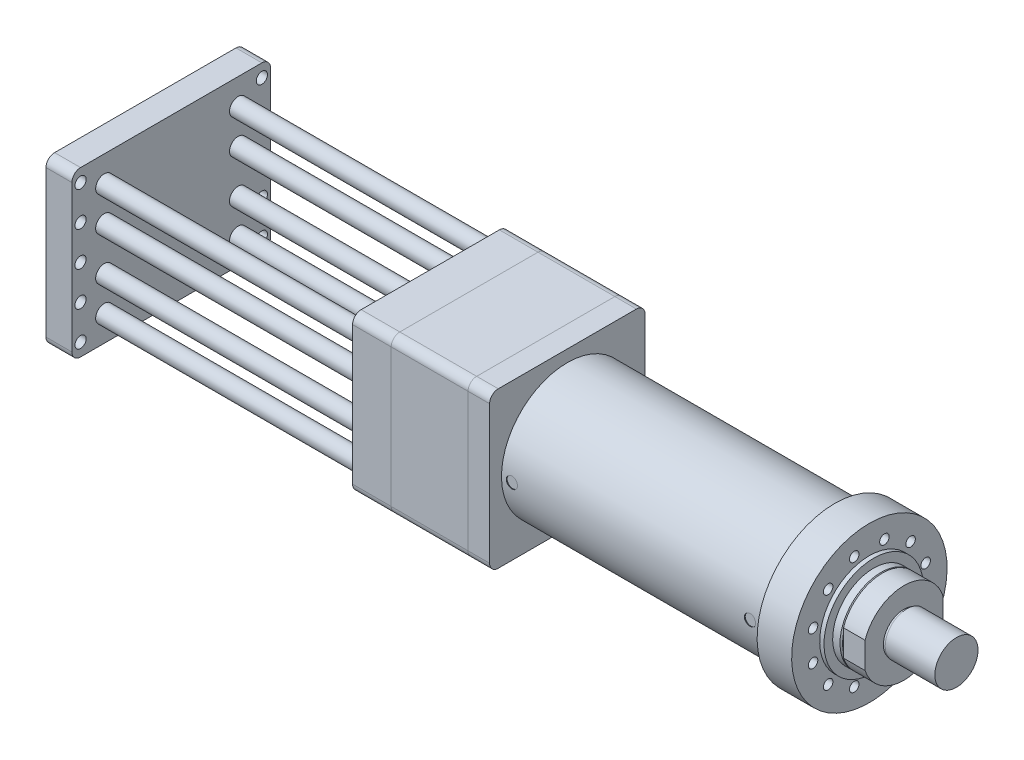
from build123d import *

# Parameters (mm, degrees)
SKETCH_2_W          = 619.5
SKETCH_2_H          = 152.5
SKETCH_3_R          = 180
SKETCH_3_R_2        = 11
EXTRUDE_1_DEPTH     = 80
SKETCH_4_R          = 115
EXTRUDE_2_DEPTH     = 10
SKETCH_5_R          = 95
EXTRUDE_3_DEPTH     = 20
CHAMFER_1_SIZE      = 3
SKETCH_17_R         = 13
CUT_EXTRUDE_6_DEPTH = 2
SKETCH_19_R         = 13
CUT_EXTRUDE_7_DEPTH = 2
SKETCH_23_W         = 360
SKETCH_23_H         = 360
EXTRUDE_8_DEPTH     = 50
EXTRUDE_9_DEPTH     = 50
SKETCH_25_R         = 47.5
EXTRUDE_10_DEPTH    = 5
SKETCH_26_R         = 50
EXTRUDE_11_DEPTH    = 115
SKETCH_28_W         = 360
SKETCH_28_H         = 360
EXTRUDE_12_DEPTH    = 178
SKETCH_29_W         = 360
SKETCH_29_H         = 360
EXTRUDE_13_DEPTH    = 89.5
FILLET_1_R          = 20
FILLET_2_R          = 20
FILLET_3_R          = 20
SKETCH_30_R         = 20
EXTRUDE_14_DEPTH    = 600
SKETCH_31_W         = 460
SKETCH_31_H         = 380
SKETCH_31_R         = 13
EXTRUDE_15_DEPTH    = 60
FILLET_4_R          = 20


with BuildPart() as part:
    # Sketch 2 → Revolve 1 (revolve)
    with BuildSketch(Plane.XY):
        with Locations((309.75, 76.25)):
            Rectangle(SKETCH_2_W, SKETCH_2_H)
    revolve(axis=Axis((619.5, 0, 0), (-1, 0, 0)))

    # Sketch 3 → Extrude 1 (add)
    with BuildSketch(Plane(origin=(619.5, 0, 0), x_dir=(0, 0, -1), z_dir=(1, 0, 0))):
        with Locations(Location((0, 0, 0), (0, 0, 90))):
            Circle(SKETCH_3_R)
        with Locations(Location((130.399986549, 34.940571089, 0), (0, 0, 90))):
            Circle(SKETCH_3_R_2, mode=Mode.SUBTRACT)
        with Locations(Location((130.399986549, -34.940571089, 0), (0, 0, 90))):
            Circle(SKETCH_3_R_2, mode=Mode.SUBTRACT)
        with Locations(Location((95.45941546, -95.45941546, 0), (0, 0, 90))):
            Circle(SKETCH_3_R_2, mode=Mode.SUBTRACT)
        with Locations(Location((34.940571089, -130.399986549, 0), (0, 0, 90))):
            Circle(SKETCH_3_R_2, mode=Mode.SUBTRACT)
        with Locations(Location((-34.940571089, -130.399986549, 0), (0, 0, 90))):
            Circle(SKETCH_3_R_2, mode=Mode.SUBTRACT)
        with Locations(Location((-95.45941546, -95.45941546, 0), (0, 0, 90))):
            Circle(SKETCH_3_R_2, mode=Mode.SUBTRACT)
        with Locations(Location((-130.399986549, -34.940571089, 0), (0, 0, 90))):
            Circle(SKETCH_3_R_2, mode=Mode.SUBTRACT)
        with Locations(Location((-130.399986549, 34.940571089, 0), (0, 0, 90))):
            Circle(SKETCH_3_R_2, mode=Mode.SUBTRACT)
        with Locations(Location((-95.45941546, 95.45941546, 0), (0, 0, 90))):
            Circle(SKETCH_3_R_2, mode=Mode.SUBTRACT)
        with Locations(Location((-34.940571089, 130.399986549, 0), (0, 0, 90))):
            Circle(SKETCH_3_R_2, mode=Mode.SUBTRACT)
        with Locations(Location((34.940571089, 130.399986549, 0), (0, 0, 90))):
            Circle(SKETCH_3_R_2, mode=Mode.SUBTRACT)
        with Locations(Location((95.45941546, 95.45941546, 0), (0, 0, 90))):
            Circle(SKETCH_3_R_2, mode=Mode.SUBTRACT)
    extrude(amount=EXTRUDE_1_DEPTH)

    # Sketch 4 → Extrude 2 (add)
    with BuildSketch(Plane(origin=(699.5, 0, 0), x_dir=(0, 0, -1), z_dir=(1, 0, 0))):
        with Locations(Location((0, 0, 0), (0, 0, 90))):
            Circle(SKETCH_4_R)
    extrude(amount=EXTRUDE_2_DEPTH)

    # Sketch 5 → Extrude 3 (add)
    with BuildSketch(Plane(origin=(709.5, 0, 0), x_dir=(0, 0, -1), z_dir=(1, 0, 0))):
        with Locations(Location((0, 0, 0), (0, 0, 90))):
            Circle(SKETCH_5_R)
    extrude(amount=EXTRUDE_3_DEPTH)

    # Chamfer 1
    chamfer_1_edges = [part.edges().sort_by_distance(p)[0] for p in [
        (729.5, -95, 0),
    ]]
    chamfer(chamfer_1_edges, length=CHAMFER_1_SIZE)

    # Sketch 17 → Cut-Extrude 6 (cut)
    with BuildSketch(Plane.XY.offset(-152.5)):
        with Locations(Location((44, 0, 0), (0, 0, 180))):
            Circle(SKETCH_17_R)
    extrude(amount=CUT_EXTRUDE_6_DEPTH, mode=Mode.SUBTRACT)

    # Sketch 19 → Cut-Extrude 7 (cut)
    with BuildSketch(Plane.XY.offset(152.5)):
        with Locations((24, 0)):
            Circle(SKETCH_19_R)
        with Locations((575.5, 0)):
            Circle(SKETCH_19_R)
    extrude(amount=-CUT_EXTRUDE_7_DEPTH, mode=Mode.SUBTRACT)

    # Sketch 23 → Extrude 8 (add)
    with BuildSketch(Plane.ZY):
        Rectangle(SKETCH_23_W, SKETCH_23_H)
    extrude(amount=EXTRUDE_8_DEPTH)

    # Sketch 24 → Extrude 9 (add)
    with BuildSketch(Plane(origin=(729.5, 0, 0), x_dir=(0, 0, -1), z_dir=(1, 0, 0))):
        with BuildLine():
            Line((-90, 30.413812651), (-90, -30.413812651))
            ThreePointArc((-90, -30.413812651), (0, -95), (90, -30.413812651))
            Line((90, -30.413812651), (90, 30.413812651))
            ThreePointArc((90, 30.413812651), (0, 95), (-90, 30.413812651))
        make_face()
    extrude(amount=EXTRUDE_9_DEPTH)

    # Sketch 25 → Extrude 10 (add)
    with BuildSketch(Plane(origin=(779.5, 0, 0), x_dir=(0, 0, -1), z_dir=(1, 0, 0))):
        with Locations(Location((0, 0, 0), (0, 0, 90))):
            Circle(SKETCH_25_R)
    extrude(amount=EXTRUDE_10_DEPTH)

    # Sketch 26 → Extrude 11 (add)
    with BuildSketch(Plane(origin=(784.5, 0, 0), x_dir=(0, 0, -1), z_dir=(1, 0, 0))):
        with Locations(Location((1.643994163, 0, 0), (0, 0, 90))):
            Circle(SKETCH_26_R)
    extrude(amount=EXTRUDE_11_DEPTH)

    # Fillet 1
    fillet_1_edges = [part.edges().sort_by_distance(p)[0] for p in [
        (-25, -180, 180),
        (-25, 180, 180),
        (-25, 180, -180),
        (-25, -180, -180),
    ]]
    fillet(fillet_1_edges, radius=FILLET_1_R)


with BuildPart() as body_2:
    # Sketch 28 → Extrude 12 (new body)
    with BuildSketch(Plane.ZY.offset(50)):
        Rectangle(SKETCH_28_W, SKETCH_28_H)
    extrude(amount=EXTRUDE_12_DEPTH)

    # Fillet 2
    fillet_2_edges = [body_2.edges().sort_by_distance(p)[0] for p in [
        (-139, -180, 180),
        (-139, -180, -180),
        (-139, 180, -180),
        (-139, 180, 180),
    ]]
    fillet(fillet_2_edges, radius=FILLET_2_R)


with BuildPart() as body_3:
    # Sketch 29 → Extrude 13 (new body)
    with BuildSketch(Plane.ZY.offset(228)):
        Rectangle(SKETCH_29_W, SKETCH_29_H)
    extrude(amount=EXTRUDE_13_DEPTH)

    # Fillet 3
    fillet_3_edges = [body_3.edges().sort_by_distance(p)[0] for p in [
        (-272.75, -180, 180),
        (-272.75, -180, -180),
        (-272.75, 180, -180),
        (-272.75, 180, 180),
    ]]
    fillet(fillet_3_edges, radius=FILLET_3_R)

    # Sketch 30 → Extrude 14 (add)
    with BuildSketch(Plane.ZY.offset(317.5)):
        with Locations(Location((-155, 130, 0), (0, 0, 270))):
            Circle(SKETCH_30_R)
        with Locations(Location((-155, 50, 0), (0, 0, 270))):
            Circle(SKETCH_30_R)
        with Locations(Location((-155, -50, 0), (0, 0, 270))):
            Circle(SKETCH_30_R)
        with Locations(Location((-155, -130, 0), (0, 0, 270))):
            Circle(SKETCH_30_R)
        with Locations(Location((155, -130, 0), (0, 0, 90))):
            Circle(SKETCH_30_R)
        with Locations(Location((155, -50, 0), (0, 0, 90))):
            Circle(SKETCH_30_R)
        with Locations(Location((155, 50, 0), (0, 0, 90))):
            Circle(SKETCH_30_R)
        with Locations(Location((155, 130, 0), (0, 0, 90))):
            Circle(SKETCH_30_R)
    extrude(amount=EXTRUDE_14_DEPTH)

    # Sketch 31 → Extrude 15 (add)
    with BuildSketch(Plane.ZY.offset(917.5)):
        Rectangle(SKETCH_31_W, SKETCH_31_H)
        with Locations(Location((-210, 160, 0), (0, 0, 270))):
            Circle(SKETCH_31_R, mode=Mode.SUBTRACT)
        with Locations(Location((-210, 0, 0), (0, 0, 270))):
            Circle(SKETCH_31_R, mode=Mode.SUBTRACT)
        with Locations(Location((-210, -80, 0), (0, 0, 270))):
            Circle(SKETCH_31_R, mode=Mode.SUBTRACT)
        with Locations(Location((-210, -160, 0), (0, 0, 270))):
            Circle(SKETCH_31_R, mode=Mode.SUBTRACT)
        with Locations(Location((-210, 80, 0), (0, 0, 270))):
            Circle(SKETCH_31_R, mode=Mode.SUBTRACT)
        with Locations(Location((210, -160, 0), (0, 0, 90))):
            Circle(SKETCH_31_R, mode=Mode.SUBTRACT)
        with Locations(Location((210, -80, 0), (0, 0, 90))):
            Circle(SKETCH_31_R, mode=Mode.SUBTRACT)
        with Locations(Location((210, 0, 0), (0, 0, 90))):
            Circle(SKETCH_31_R, mode=Mode.SUBTRACT)
        with Locations(Location((210, 80, 0), (0, 0, 90))):
            Circle(SKETCH_31_R, mode=Mode.SUBTRACT)
        with Locations(Location((210, 160, 0), (0, 0, 90))):
            Circle(SKETCH_31_R, mode=Mode.SUBTRACT)
    extrude(amount=EXTRUDE_15_DEPTH)

    # Fillet 4
    fillet_4_edges = [body_3.edges().sort_by_distance(p)[0] for p in [
        (-947.5, -190, 230),
        (-947.5, 190, 230),
        (-947.5, 190, -230),
        (-947.5, -190, -230),
    ]]
    fillet(fillet_4_edges, radius=FILLET_4_R)


solid = Compound([part.part, body_2.part, body_3.part])
